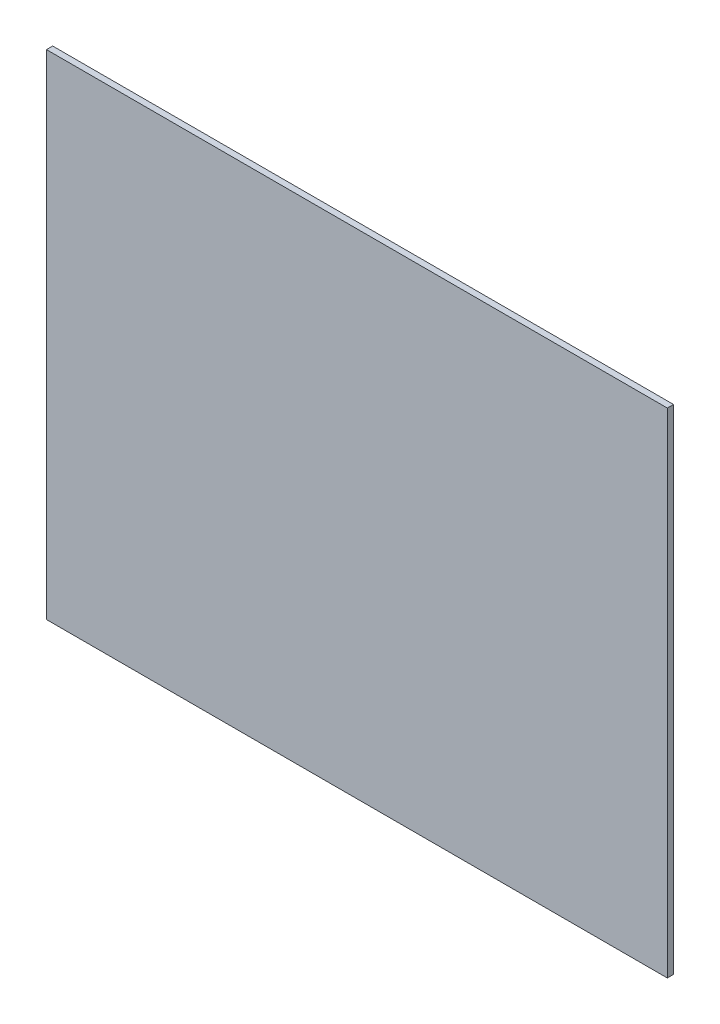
from build123d import *

# Parameters (mm, degrees)
ESQUISSE1_W      = 1000
ESQUISSE1_H      = 795
EXTRUSION1_DEPTH = 10


with BuildPart() as part:
    # Esquisse1 → Extrusion1 (new body)
    with BuildSketch(Plane.XY):
        with Locations((500, 397.5)):
            Rectangle(ESQUISSE1_W, ESQUISSE1_H)
    extrude(amount=EXTRUSION1_DEPTH)


solid = part.part
